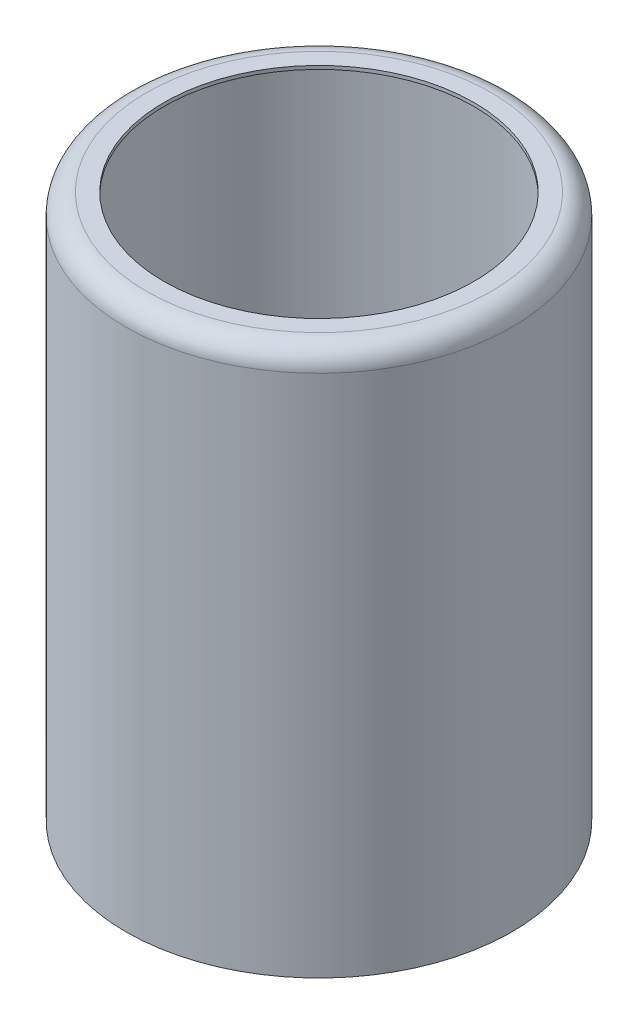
ISO-10303-21;
HEADER;
FILE_DESCRIPTION(('STEP AP214'),'2;1');
FILE_NAME('part.step','',(''),(''),'','','');
FILE_SCHEMA(('AUTOMOTIVE_DESIGN { 1 0 10303 214 1 1 1 1 }'));
ENDSEC;
DATA;
#1=APPLICATION_CONTEXT('core data for automotive mechanical design processes');
#2=APPLICATION_PROTOCOL_DEFINITION('international standard','automotive_design',2000,#1);
#3=PRODUCT_CONTEXT('',#1,'mechanical');
#4=PRODUCT('Part','Part','',(#3));
#5=PRODUCT_RELATED_PRODUCT_CATEGORY('part','',(#4));
#6=PRODUCT_DEFINITION_FORMATION('','',#4);
#7=PRODUCT_DEFINITION_CONTEXT('part definition',#1,'design');
#8=PRODUCT_DEFINITION('design','',#6,#7);
#9=PRODUCT_DEFINITION_SHAPE('','',#8);
#10=(LENGTH_UNIT() NAMED_UNIT(*) SI_UNIT(.MILLI.,.METRE.));
#11=(NAMED_UNIT(*) PLANE_ANGLE_UNIT() SI_UNIT($,.RADIAN.));
#12=(NAMED_UNIT(*) SI_UNIT($,.STERADIAN.) SOLID_ANGLE_UNIT());
#13=UNCERTAINTY_MEASURE_WITH_UNIT(LENGTH_MEASURE(1.E-05),#10,'distance_accuracy_value','');
#14=(GEOMETRIC_REPRESENTATION_CONTEXT(3) GLOBAL_UNCERTAINTY_ASSIGNED_CONTEXT((#13)) GLOBAL_UNIT_ASSIGNED_CONTEXT((#10,
#11,#12)) REPRESENTATION_CONTEXT('',''));
#15=CARTESIAN_POINT('',(0.,0.,0.));
#16=DIRECTION('',(0.,0.,1.));
#17=DIRECTION('',(1.,0.,0.));
#18=AXIS2_PLACEMENT_3D('',#15,#16,#17);
#19=CARTESIAN_POINT('',(0.,7.98282511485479,0.));
#20=DIRECTION('',(0.,1.,0.));
#21=DIRECTION('',(0.,0.,1.));
#22=AXIS2_PLACEMENT_3D('',#19,#20,#21);
#23=CYLINDRICAL_SURFACE('',#22,4.5);
#24=CARTESIAN_POINT('',(0.,-15.7,0.));
#25=DIRECTION('',(0.,1.,0.));
#26=DIRECTION('',(0.,0.,1.));
#27=AXIS2_PLACEMENT_3D('',#24,#25,#26);
#28=CIRCLE('',#27,4.5);
#29=CARTESIAN_POINT('',(0.,-15.7,4.5));
#30=VERTEX_POINT('',#29);
#31=EDGE_CURVE('E65',#30,#30,#28,.T.);
#32=ORIENTED_EDGE('',*,*,#31,.F.);
#33=EDGE_LOOP('',(#32));
#34=FACE_BOUND('',#33,.T.);
#35=CARTESIAN_POINT('',(0.,-15.6,0.));
#36=DIRECTION('',(0.,1.,0.));
#37=DIRECTION('',(0.,0.,1.));
#38=AXIS2_PLACEMENT_3D('',#35,#36,#37);
#39=CIRCLE('',#38,4.5);
#40=CARTESIAN_POINT('',(0.,-15.6,4.5));
#41=VERTEX_POINT('',#40);
#42=EDGE_CURVE('E10',#41,#41,#39,.T.);
#43=ORIENTED_EDGE('',*,*,#42,.T.);
#44=EDGE_LOOP('',(#43));
#45=FACE_BOUND('',#44,.T.);
#46=ADVANCED_FACE('F31',(#34,#45),#23,.F.);
#47=CARTESIAN_POINT('',(5.5,-15.6,0.));
#48=DIRECTION('',(0.,-1.,0.));
#49=DIRECTION('',(0.,0.,-1.));
#50=AXIS2_PLACEMENT_3D('',#47,#48,#49);
#51=PLANE('',#50);
#52=ORIENTED_EDGE('',*,*,#42,.F.);
#53=EDGE_LOOP('',(#52));
#54=FACE_BOUND('',#53,.T.);
#55=CARTESIAN_POINT('',(0.,-15.6,0.));
#56=DIRECTION('',(0.,1.,0.));
#57=DIRECTION('',(0.,0.,1.));
#58=AXIS2_PLACEMENT_3D('',#55,#56,#57);
#59=CIRCLE('',#58,5.5);
#60=CARTESIAN_POINT('',(0.,-15.6,5.5));
#61=VERTEX_POINT('',#60);
#62=EDGE_CURVE('E37',#61,#61,#59,.T.);
#63=ORIENTED_EDGE('',*,*,#62,.T.);
#64=EDGE_LOOP('',(#63));
#65=FACE_BOUND('',#64,.T.);
#66=ADVANCED_FACE('F72',(#54,#65),#51,.F.);
#67=CARTESIAN_POINT('',(0.,7.98282511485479,0.));
#68=DIRECTION('',(0.,1.,0.));
#69=DIRECTION('',(0.,0.,1.));
#70=AXIS2_PLACEMENT_3D('',#67,#68,#69);
#71=CYLINDRICAL_SURFACE('',#70,5.5);
#72=ORIENTED_EDGE('',*,*,#62,.F.);
#73=EDGE_LOOP('',(#72));
#74=FACE_BOUND('',#73,.T.);
#75=CARTESIAN_POINT('',(0.,-0.500000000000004,0.));
#76=DIRECTION('',(0.,1.,0.));
#77=DIRECTION('',(0.,0.,1.));
#78=AXIS2_PLACEMENT_3D('',#75,#76,#77);
#79=CIRCLE('',#78,5.5);
#80=CARTESIAN_POINT('',(0.,-0.500000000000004,5.5));
#81=VERTEX_POINT('',#80);
#82=EDGE_CURVE('E41',#81,#81,#79,.T.);
#83=ORIENTED_EDGE('',*,*,#82,.T.);
#84=EDGE_LOOP('',(#83));
#85=FACE_BOUND('',#84,.T.);
#86=ADVANCED_FACE('F76',(#74,#85),#71,.F.);
#87=CARTESIAN_POINT('',(0.,-0.5,0.));
#88=DIRECTION('',(0.,1.,0.));
#89=DIRECTION('',(0.,0.,1.));
#90=AXIS2_PLACEMENT_3D('',#87,#88,#89);
#91=TOROIDAL_SURFACE('',#90,5.,0.5);
#92=ORIENTED_EDGE('',*,*,#82,.F.);
#93=EDGE_LOOP('',(#92));
#94=FACE_BOUND('',#93,.T.);
#95=CARTESIAN_POINT('',(0.,0.,0.));
#96=DIRECTION('',(0.,1.,0.));
#97=DIRECTION('',(0.,0.,1.));
#98=AXIS2_PLACEMENT_3D('',#95,#96,#97);
#99=CIRCLE('',#98,5.);
#100=CARTESIAN_POINT('',(0.,0.,5.));
#101=VERTEX_POINT('',#100);
#102=EDGE_CURVE('E45',#101,#101,#99,.T.);
#103=ORIENTED_EDGE('',*,*,#102,.T.);
#104=EDGE_LOOP('',(#103));
#105=FACE_BOUND('',#104,.T.);
#106=ADVANCED_FACE('F81',(#94,#105),#91,.F.);
#107=CARTESIAN_POINT('',(5.,0.,0.));
#108=DIRECTION('',(0.,1.,0.));
#109=DIRECTION('',(0.,0.,1.));
#110=AXIS2_PLACEMENT_3D('',#107,#108,#109);
#111=PLANE('',#110);
#112=ORIENTED_EDGE('',*,*,#102,.F.);
#113=EDGE_LOOP('',(#112));
#114=FACE_BOUND('',#113,.T.);
#115=CARTESIAN_POINT('',(0.,0.,0.));
#116=DIRECTION('',(0.,1.,0.));
#117=DIRECTION('',(0.,0.,1.));
#118=AXIS2_PLACEMENT_3D('',#115,#116,#117);
#119=CIRCLE('',#118,4.5);
#120=CARTESIAN_POINT('',(0.,0.,4.5));
#121=VERTEX_POINT('',#120);
#122=EDGE_CURVE('E50',#121,#121,#119,.T.);
#123=ORIENTED_EDGE('',*,*,#122,.T.);
#124=EDGE_LOOP('',(#123));
#125=FACE_BOUND('',#124,.T.);
#126=ADVANCED_FACE('F87',(#114,#125),#111,.F.);
#127=CARTESIAN_POINT('',(0.,7.98282511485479,0.));
#128=DIRECTION('',(0.,1.,0.));
#129=DIRECTION('',(0.,0.,1.));
#130=AXIS2_PLACEMENT_3D('',#127,#128,#129);
#131=CYLINDRICAL_SURFACE('',#130,4.5);
#132=ORIENTED_EDGE('',*,*,#122,.F.);
#133=EDGE_LOOP('',(#132));
#134=FACE_BOUND('',#133,.T.);
#135=CARTESIAN_POINT('',(0.,0.0999999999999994,0.));
#136=DIRECTION('',(0.,1.,0.));
#137=DIRECTION('',(0.,0.,1.));
#138=AXIS2_PLACEMENT_3D('',#135,#136,#137);
#139=CIRCLE('',#138,4.5);
#140=CARTESIAN_POINT('',(0.,0.0999999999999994,4.5));
#141=VERTEX_POINT('',#140);
#142=EDGE_CURVE('E53',#141,#141,#139,.T.);
#143=ORIENTED_EDGE('',*,*,#142,.T.);
#144=EDGE_LOOP('',(#143));
#145=FACE_BOUND('',#144,.T.);
#146=ADVANCED_FACE('F91',(#134,#145),#131,.F.);
#147=CARTESIAN_POINT('',(4.99999999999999,0.1,0.));
#148=DIRECTION('',(0.,-1.,0.));
#149=DIRECTION('',(0.,0.,-1.));
#150=AXIS2_PLACEMENT_3D('',#147,#148,#149);
#151=PLANE('',#150);
#152=ORIENTED_EDGE('',*,*,#142,.F.);
#153=EDGE_LOOP('',(#152));
#154=FACE_BOUND('',#153,.T.);
#155=CARTESIAN_POINT('',(0.,0.0999999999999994,0.));
#156=DIRECTION('',(0.,1.,0.));
#157=DIRECTION('',(0.,0.,1.));
#158=AXIS2_PLACEMENT_3D('',#155,#156,#157);
#159=CIRCLE('',#158,4.99999999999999);
#160=CARTESIAN_POINT('',(0.,0.0999999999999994,4.99999999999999));
#161=VERTEX_POINT('',#160);
#162=EDGE_CURVE('E56',#161,#161,#159,.T.);
#163=ORIENTED_EDGE('',*,*,#162,.T.);
#164=EDGE_LOOP('',(#163));
#165=FACE_BOUND('',#164,.T.);
#166=ADVANCED_FACE('F95',(#154,#165),#151,.F.);
#167=CARTESIAN_POINT('',(0.,-0.5,0.));
#168=DIRECTION('',(0.,1.,0.));
#169=DIRECTION('',(0.,0.,1.));
#170=AXIS2_PLACEMENT_3D('',#167,#168,#169);
#171=TOROIDAL_SURFACE('',#170,5.,0.6);
#172=ORIENTED_EDGE('',*,*,#162,.F.);
#173=EDGE_LOOP('',(#172));
#174=FACE_BOUND('',#173,.T.);
#175=CARTESIAN_POINT('',(0.,-0.500000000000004,0.));
#176=DIRECTION('',(0.,1.,0.));
#177=DIRECTION('',(0.,0.,1.));
#178=AXIS2_PLACEMENT_3D('',#175,#176,#177);
#179=CIRCLE('',#178,5.6);
#180=CARTESIAN_POINT('',(0.,-0.500000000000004,5.6));
#181=VERTEX_POINT('',#180);
#182=EDGE_CURVE('E59',#181,#181,#179,.T.);
#183=ORIENTED_EDGE('',*,*,#182,.T.);
#184=EDGE_LOOP('',(#183));
#185=FACE_BOUND('',#184,.T.);
#186=ADVANCED_FACE('F99',(#174,#185),#171,.T.);
#187=CARTESIAN_POINT('',(0.,7.98282511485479,0.));
#188=DIRECTION('',(0.,1.,0.));
#189=DIRECTION('',(0.,0.,1.));
#190=AXIS2_PLACEMENT_3D('',#187,#188,#189);
#191=CYLINDRICAL_SURFACE('',#190,5.6);
#192=ORIENTED_EDGE('',*,*,#182,.F.);
#193=EDGE_LOOP('',(#192));
#194=FACE_BOUND('',#193,.T.);
#195=CARTESIAN_POINT('',(0.,-15.7,0.));
#196=DIRECTION('',(0.,1.,0.));
#197=DIRECTION('',(0.,0.,1.));
#198=AXIS2_PLACEMENT_3D('',#195,#196,#197);
#199=CIRCLE('',#198,5.6);
#200=CARTESIAN_POINT('',(0.,-15.7,5.6));
#201=VERTEX_POINT('',#200);
#202=EDGE_CURVE('E62',#201,#201,#199,.T.);
#203=ORIENTED_EDGE('',*,*,#202,.T.);
#204=EDGE_LOOP('',(#203));
#205=FACE_BOUND('',#204,.T.);
#206=ADVANCED_FACE('F103',(#194,#205),#191,.T.);
#207=CARTESIAN_POINT('',(5.6,-15.7,0.));
#208=DIRECTION('',(0.,1.,0.));
#209=DIRECTION('',(0.,0.,1.));
#210=AXIS2_PLACEMENT_3D('',#207,#208,#209);
#211=PLANE('',#210);
#212=ORIENTED_EDGE('',*,*,#202,.F.);
#213=EDGE_LOOP('',(#212));
#214=FACE_BOUND('',#213,.T.);
#215=ORIENTED_EDGE('',*,*,#31,.T.);
#216=EDGE_LOOP('',(#215));
#217=FACE_BOUND('',#216,.T.);
#218=ADVANCED_FACE('F69',(#214,#217),#211,.F.);
#219=CLOSED_SHELL('',(#46,#66,#86,#106,#126,#146,#166,#186,#206,#218));
#220=MANIFOLD_SOLID_BREP('B2',#219);
#221=ADVANCED_BREP_SHAPE_REPRESENTATION('',(#18,#220),#14);
#222=SHAPE_DEFINITION_REPRESENTATION(#9,#221);
ENDSEC;
END-ISO-10303-21;
